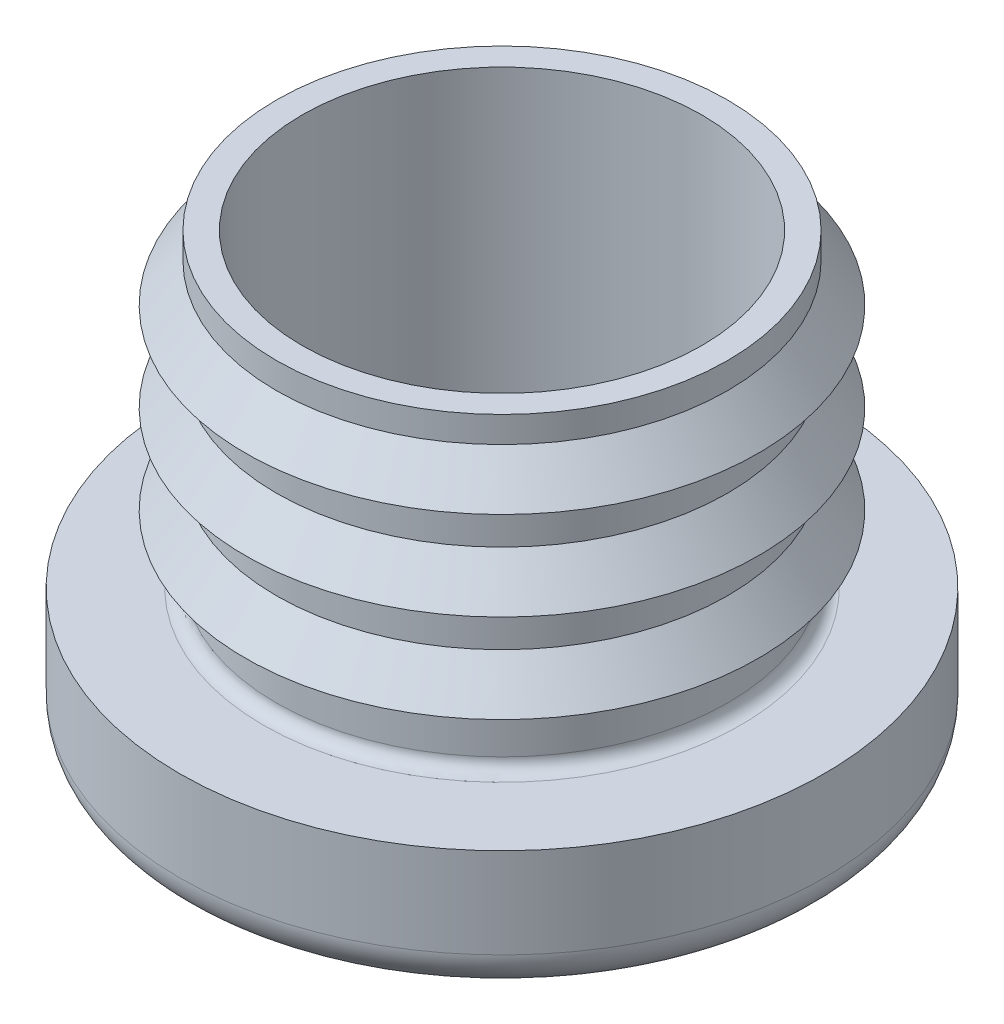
from build123d import *


with BuildPart() as part:
    # Esquisse1 → R_volution1 (revolve)
    with BuildSketch(Plane.XY, mode=Mode.PRIVATE) as r_volution1_sk:
        with BuildLine():
            Line((-11, 0), (0, 0))
            Line((0, 0), (0, 3))
            Line((0, 3), (-7.25, 3))
            ThreePointArc((-7.25, 3), (-7.603553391, 3.146446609), (-7.75, 3.5))
            Line((-7.75, 3.5), (-7.75, 17))
            Line((-7.75, 17), (-8.75, 17))
            Line((-8.75, 17), (-8.75, 15.987609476))
            Line((-8.75, 15.987609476), (-9.949674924, 14.487609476))
            Line((-9.949674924, 14.487609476), (-8.75, 14.487609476))
            Line((-8.75, 14.487609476), (-8.75, 12.543804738))
            Line((-8.75, 12.543804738), (-9.949674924, 11.043804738))
            Line((-9.949674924, 11.043804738), (-8.75, 11.043804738))
            Line((-8.75, 11.043804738), (-8.75, 9.1))
            Line((-8.75, 9.1), (-9.949674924, 7.6))
            Line((-9.949674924, 7.6), (-8.75, 7.6))
            Line((-8.75, 7.6), (-8.75, 5.5))
            ThreePointArc((-8.75, 5.5), (-8.896446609, 5.146446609), (-9.25, 5))
            Line((-9.25, 5), (-12.5, 5))
            Line((-12.5, 5), (-12.5, 1.5))
            ThreePointArc((-12.5, 1.5), (-12.060660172, 0.439339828), (-11, 0))
        make_face()
    revolve(r_volution1_sk.sketch.rotate(Axis((0, 0, 0), (0, 1, 0)), 270), axis=Axis((0, 0, 0), (0, 1, 0)))


solid = part.part
